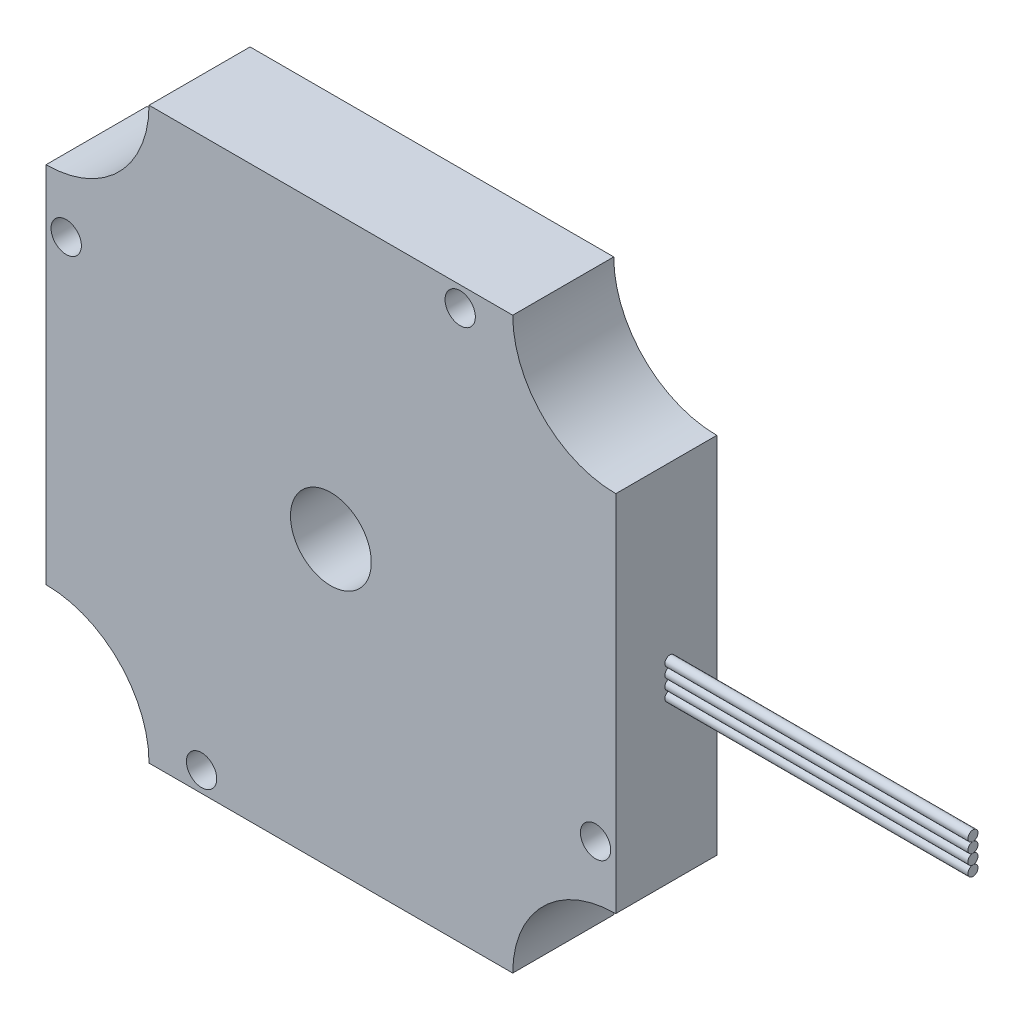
ISO-10303-21;
HEADER;
FILE_DESCRIPTION(('STEP AP214'),'2;1');
FILE_NAME('part.step','',(''),(''),'','','');
FILE_SCHEMA(('AUTOMOTIVE_DESIGN { 1 0 10303 214 1 1 1 1 }'));
ENDSEC;
DATA;
#1=APPLICATION_CONTEXT('core data for automotive mechanical design processes');
#2=APPLICATION_PROTOCOL_DEFINITION('international standard','automotive_design',2000,#1);
#3=PRODUCT_CONTEXT('',#1,'mechanical');
#4=PRODUCT('Part','Part','',(#3));
#5=PRODUCT_RELATED_PRODUCT_CATEGORY('part','',(#4));
#6=PRODUCT_DEFINITION_FORMATION('','',#4);
#7=PRODUCT_DEFINITION_CONTEXT('part definition',#1,'design');
#8=PRODUCT_DEFINITION('design','',#6,#7);
#9=PRODUCT_DEFINITION_SHAPE('','',#8);
#10=(LENGTH_UNIT() NAMED_UNIT(*) SI_UNIT(.MILLI.,.METRE.));
#11=(NAMED_UNIT(*) PLANE_ANGLE_UNIT() SI_UNIT($,.RADIAN.));
#12=(NAMED_UNIT(*) SI_UNIT($,.STERADIAN.) SOLID_ANGLE_UNIT());
#13=UNCERTAINTY_MEASURE_WITH_UNIT(LENGTH_MEASURE(1.E-05),#10,'distance_accuracy_value','');
#14=(GEOMETRIC_REPRESENTATION_CONTEXT(3) GLOBAL_UNCERTAINTY_ASSIGNED_CONTEXT((#13)) GLOBAL_UNIT_ASSIGNED_CONTEXT((#10,
#11,#12)) REPRESENTATION_CONTEXT('',''));
#15=CARTESIAN_POINT('',(0.,0.,0.));
#16=DIRECTION('',(0.,0.,1.));
#17=DIRECTION('',(1.,0.,0.));
#18=AXIS2_PLACEMENT_3D('',#15,#16,#17);
#19=CARTESIAN_POINT('',(58.2,-2.,4.64344868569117));
#20=DIRECTION('',(-1.,0.,0.));
#21=DIRECTION('',(0.,0.,1.));
#22=AXIS2_PLACEMENT_3D('',#19,#20,#21);
#23=CYLINDRICAL_SURFACE('',#22,0.500000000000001);
#24=CARTESIAN_POINT('',(28.2,-2.,4.64344868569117));
#25=DIRECTION('',(1.,0.,0.));
#26=DIRECTION('',(0.,0.,-1.));
#27=AXIS2_PLACEMENT_3D('',#24,#25,#26);
#28=CIRCLE('',#27,0.500000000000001);
#29=CARTESIAN_POINT('',(28.2,-2.,4.14344868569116));
#30=VERTEX_POINT('',#29);
#31=EDGE_CURVE('E12',#30,#30,#28,.T.);
#32=ORIENTED_EDGE('',*,*,#31,.T.);
#33=EDGE_LOOP('',(#32));
#34=FACE_BOUND('',#33,.T.);
#35=CARTESIAN_POINT('',(58.2,-2.,4.64344868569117));
#36=DIRECTION('',(1.,0.,0.));
#37=DIRECTION('',(0.,0.,-1.));
#38=AXIS2_PLACEMENT_3D('',#35,#36,#37);
#39=CIRCLE('',#38,0.500000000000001);
#40=CARTESIAN_POINT('',(58.2,-2.,4.14344868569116));
#41=VERTEX_POINT('',#40);
#42=EDGE_CURVE('E55',#41,#41,#39,.T.);
#43=ORIENTED_EDGE('',*,*,#42,.F.);
#44=EDGE_LOOP('',(#43));
#45=FACE_BOUND('',#44,.T.);
#46=ADVANCED_FACE('F51',(#34,#45),#23,.T.);
#47=CARTESIAN_POINT('',(58.2,-2.,4.64344868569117));
#48=DIRECTION('',(1.,0.,0.));
#49=DIRECTION('',(0.,0.,-1.));
#50=AXIS2_PLACEMENT_3D('',#47,#48,#49);
#51=PLANE('',#50);
#52=ORIENTED_EDGE('',*,*,#42,.T.);
#53=EDGE_LOOP('',(#52));
#54=FACE_BOUND('',#53,.T.);
#55=ADVANCED_FACE('F53',(#54),#51,.T.);
#56=CARTESIAN_POINT('',(28.2,-2.,4.64344868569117));
#57=DIRECTION('',(1.,0.,0.));
#58=DIRECTION('',(0.,0.,-1.));
#59=AXIS2_PLACEMENT_3D('',#56,#57,#58);
#60=PLANE('',#59);
#61=ORIENTED_EDGE('',*,*,#31,.F.);
#62=EDGE_LOOP('',(#61));
#63=FACE_BOUND('',#62,.T.);
#64=ADVANCED_FACE('F70',(#63),#60,.F.);
#65=CLOSED_SHELL('',(#46,#55,#64));
#66=MANIFOLD_SOLID_BREP('B2',#65);
#67=CARTESIAN_POINT('',(58.2,-1.,4.64344868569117));
#68=DIRECTION('',(-1.,0.,0.));
#69=DIRECTION('',(0.,0.,1.));
#70=AXIS2_PLACEMENT_3D('',#67,#68,#69);
#71=CYLINDRICAL_SURFACE('',#70,0.500000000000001);
#72=CARTESIAN_POINT('',(28.2,-1.,4.64344868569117));
#73=DIRECTION('',(1.,0.,0.));
#74=DIRECTION('',(0.,0.,-1.));
#75=AXIS2_PLACEMENT_3D('',#72,#73,#74);
#76=CIRCLE('',#75,0.500000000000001);
#77=CARTESIAN_POINT('',(28.2,-1.,4.14344868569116));
#78=VERTEX_POINT('',#77);
#79=EDGE_CURVE('E50',#78,#78,#76,.T.);
#80=ORIENTED_EDGE('',*,*,#79,.T.);
#81=EDGE_LOOP('',(#80));
#82=FACE_BOUND('',#81,.T.);
#83=CARTESIAN_POINT('',(58.2,-1.,4.64344868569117));
#84=DIRECTION('',(1.,0.,0.));
#85=DIRECTION('',(0.,0.,-1.));
#86=AXIS2_PLACEMENT_3D('',#83,#84,#85);
#87=CIRCLE('',#86,0.500000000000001);
#88=CARTESIAN_POINT('',(58.2,-1.,4.14344868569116));
#89=VERTEX_POINT('',#88);
#90=EDGE_CURVE('E103',#89,#89,#87,.T.);
#91=ORIENTED_EDGE('',*,*,#90,.F.);
#92=EDGE_LOOP('',(#91));
#93=FACE_BOUND('',#92,.T.);
#94=ADVANCED_FACE('F99',(#82,#93),#71,.T.);
#95=CARTESIAN_POINT('',(58.2,-1.,4.64344868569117));
#96=DIRECTION('',(1.,0.,0.));
#97=DIRECTION('',(0.,0.,-1.));
#98=AXIS2_PLACEMENT_3D('',#95,#96,#97);
#99=PLANE('',#98);
#100=ORIENTED_EDGE('',*,*,#90,.T.);
#101=EDGE_LOOP('',(#100));
#102=FACE_BOUND('',#101,.T.);
#103=ADVANCED_FACE('F101',(#102),#99,.T.);
#104=CARTESIAN_POINT('',(28.2,-1.,4.64344868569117));
#105=DIRECTION('',(1.,0.,0.));
#106=DIRECTION('',(0.,0.,-1.));
#107=AXIS2_PLACEMENT_3D('',#104,#105,#106);
#108=PLANE('',#107);
#109=ORIENTED_EDGE('',*,*,#79,.F.);
#110=EDGE_LOOP('',(#109));
#111=FACE_BOUND('',#110,.T.);
#112=ADVANCED_FACE('F118',(#111),#108,.F.);
#113=CLOSED_SHELL('',(#94,#103,#112));
#114=MANIFOLD_SOLID_BREP('B7',#113);
#115=CARTESIAN_POINT('',(58.2,0.,4.64344868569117));
#116=DIRECTION('',(-1.,0.,0.));
#117=DIRECTION('',(0.,0.,1.));
#118=AXIS2_PLACEMENT_3D('',#115,#116,#117);
#119=CYLINDRICAL_SURFACE('',#118,0.500000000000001);
#120=CARTESIAN_POINT('',(28.2,0.,4.64344868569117));
#121=DIRECTION('',(1.,0.,0.));
#122=DIRECTION('',(0.,0.,-1.));
#123=AXIS2_PLACEMENT_3D('',#120,#121,#122);
#124=CIRCLE('',#123,0.500000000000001);
#125=CARTESIAN_POINT('',(28.2,0.,4.14344868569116));
#126=VERTEX_POINT('',#125);
#127=EDGE_CURVE('E98',#126,#126,#124,.T.);
#128=ORIENTED_EDGE('',*,*,#127,.T.);
#129=EDGE_LOOP('',(#128));
#130=FACE_BOUND('',#129,.T.);
#131=CARTESIAN_POINT('',(58.2,0.,4.64344868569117));
#132=DIRECTION('',(1.,0.,0.));
#133=DIRECTION('',(0.,0.,-1.));
#134=AXIS2_PLACEMENT_3D('',#131,#132,#133);
#135=CIRCLE('',#134,0.500000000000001);
#136=CARTESIAN_POINT('',(58.2,0.,4.14344868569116));
#137=VERTEX_POINT('',#136);
#138=EDGE_CURVE('E151',#137,#137,#135,.T.);
#139=ORIENTED_EDGE('',*,*,#138,.F.);
#140=EDGE_LOOP('',(#139));
#141=FACE_BOUND('',#140,.T.);
#142=ADVANCED_FACE('F147',(#130,#141),#119,.T.);
#143=CARTESIAN_POINT('',(58.2,0.,4.64344868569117));
#144=DIRECTION('',(1.,0.,0.));
#145=DIRECTION('',(0.,0.,-1.));
#146=AXIS2_PLACEMENT_3D('',#143,#144,#145);
#147=PLANE('',#146);
#148=ORIENTED_EDGE('',*,*,#138,.T.);
#149=EDGE_LOOP('',(#148));
#150=FACE_BOUND('',#149,.T.);
#151=ADVANCED_FACE('F149',(#150),#147,.T.);
#152=CARTESIAN_POINT('',(28.2,0.,4.64344868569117));
#153=DIRECTION('',(1.,0.,0.));
#154=DIRECTION('',(0.,0.,-1.));
#155=AXIS2_PLACEMENT_3D('',#152,#153,#154);
#156=PLANE('',#155);
#157=ORIENTED_EDGE('',*,*,#127,.F.);
#158=EDGE_LOOP('',(#157));
#159=FACE_BOUND('',#158,.T.);
#160=ADVANCED_FACE('F166',(#159),#156,.F.);
#161=CLOSED_SHELL('',(#142,#151,#160));
#162=MANIFOLD_SOLID_BREP('B45',#161);
#163=CARTESIAN_POINT('',(58.2,1.,4.64344868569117));
#164=DIRECTION('',(-1.,0.,0.));
#165=DIRECTION('',(0.,0.,1.));
#166=AXIS2_PLACEMENT_3D('',#163,#164,#165);
#167=CYLINDRICAL_SURFACE('',#166,0.500000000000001);
#168=CARTESIAN_POINT('',(28.2,1.,4.64344868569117));
#169=DIRECTION('',(1.,0.,0.));
#170=DIRECTION('',(0.,0.,-1.));
#171=AXIS2_PLACEMENT_3D('',#168,#169,#170);
#172=CIRCLE('',#171,0.500000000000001);
#173=CARTESIAN_POINT('',(28.2,1.,4.14344868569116));
#174=VERTEX_POINT('',#173);
#175=EDGE_CURVE('E199',#174,#174,#172,.T.);
#176=ORIENTED_EDGE('',*,*,#175,.T.);
#177=EDGE_LOOP('',(#176));
#178=FACE_BOUND('',#177,.T.);
#179=CARTESIAN_POINT('',(58.2,1.,4.64344868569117));
#180=DIRECTION('',(1.,0.,0.));
#181=DIRECTION('',(0.,0.,-1.));
#182=AXIS2_PLACEMENT_3D('',#179,#180,#181);
#183=CIRCLE('',#182,0.500000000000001);
#184=CARTESIAN_POINT('',(58.2,1.,4.14344868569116));
#185=VERTEX_POINT('',#184);
#186=EDGE_CURVE('E146',#185,#185,#183,.T.);
#187=ORIENTED_EDGE('',*,*,#186,.F.);
#188=EDGE_LOOP('',(#187));
#189=FACE_BOUND('',#188,.T.);
#190=ADVANCED_FACE('F196',(#178,#189),#167,.T.);
#191=CARTESIAN_POINT('',(58.2,1.,4.64344868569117));
#192=DIRECTION('',(1.,0.,0.));
#193=DIRECTION('',(0.,0.,-1.));
#194=AXIS2_PLACEMENT_3D('',#191,#192,#193);
#195=PLANE('',#194);
#196=ORIENTED_EDGE('',*,*,#186,.T.);
#197=EDGE_LOOP('',(#196));
#198=FACE_BOUND('',#197,.T.);
#199=ADVANCED_FACE('F212',(#198),#195,.T.);
#200=CARTESIAN_POINT('',(28.2,1.,4.64344868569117));
#201=DIRECTION('',(1.,0.,0.));
#202=DIRECTION('',(0.,0.,-1.));
#203=AXIS2_PLACEMENT_3D('',#200,#201,#202);
#204=PLANE('',#203);
#205=ORIENTED_EDGE('',*,*,#175,.F.);
#206=EDGE_LOOP('',(#205));
#207=FACE_BOUND('',#206,.T.);
#208=ADVANCED_FACE('F210',(#207),#204,.F.);
#209=CLOSED_SHELL('',(#190,#199,#208));
#210=MANIFOLD_SOLID_BREP('B93',#209);
#211=CARTESIAN_POINT('',(-28.2,28.2,10.));
#212=DIRECTION('',(0.,0.,-1.));
#213=DIRECTION('',(-1.,0.,0.));
#214=AXIS2_PLACEMENT_3D('',#211,#212,#213);
#215=CYLINDRICAL_SURFACE('',#214,10.2);
#216=CARTESIAN_POINT('',(-28.2,28.2,0.));
#217=DIRECTION('',(0.,0.,-1.));
#218=DIRECTION('',(1.,0.,0.));
#219=AXIS2_PLACEMENT_3D('',#216,#217,#218);
#220=CIRCLE('',#219,10.2);
#221=CARTESIAN_POINT('',(-18.,28.2,0.));
#222=VERTEX_POINT('',#221);
#223=CARTESIAN_POINT('',(-28.2,18.,0.));
#224=VERTEX_POINT('',#223);
#225=EDGE_CURVE('E333',#222,#224,#220,.T.);
#226=ORIENTED_EDGE('',*,*,#225,.T.);
#227=DIRECTION('',(0.,0.,-1.));
#228=VECTOR('',#227,1.);
#229=CARTESIAN_POINT('',(-28.2,18.,10.));
#230=LINE('',#229,#228);
#231=CARTESIAN_POINT('',(-28.2,18.,10.));
#232=VERTEX_POINT('',#231);
#233=EDGE_CURVE('E194',#232,#224,#230,.T.);
#234=ORIENTED_EDGE('',*,*,#233,.F.);
#235=CARTESIAN_POINT('',(-28.2,28.2,10.));
#236=DIRECTION('',(0.,0.,-1.));
#237=DIRECTION('',(1.,0.,0.));
#238=AXIS2_PLACEMENT_3D('',#235,#236,#237);
#239=CIRCLE('',#238,10.2);
#240=CARTESIAN_POINT('',(-18.,28.2,10.));
#241=VERTEX_POINT('',#240);
#242=EDGE_CURVE('E348',#241,#232,#239,.T.);
#243=ORIENTED_EDGE('',*,*,#242,.F.);
#244=DIRECTION('',(0.,0.,-1.));
#245=VECTOR('',#244,1.);
#246=CARTESIAN_POINT('',(-18.,28.2,10.));
#247=LINE('',#246,#245);
#248=EDGE_CURVE('E329',#241,#222,#247,.T.);
#249=ORIENTED_EDGE('',*,*,#248,.T.);
#250=EDGE_LOOP('',(#226,#234,#243,#249));
#251=FACE_BOUND('',#250,.T.);
#252=ADVANCED_FACE('F237',(#251),#215,.F.);
#253=CARTESIAN_POINT('',(-28.2,-18.,10.));
#254=DIRECTION('',(1.,0.,0.));
#255=DIRECTION('',(0.,0.,-1.));
#256=AXIS2_PLACEMENT_3D('',#253,#254,#255);
#257=PLANE('',#256);
#258=DIRECTION('',(0.,-1.,0.));
#259=VECTOR('',#258,1.);
#260=CARTESIAN_POINT('',(-28.2,-18.,0.));
#261=LINE('',#260,#259);
#262=CARTESIAN_POINT('',(-28.2,-18.,0.));
#263=VERTEX_POINT('',#262);
#264=EDGE_CURVE('E336',#224,#263,#261,.T.);
#265=ORIENTED_EDGE('',*,*,#264,.T.);
#266=DIRECTION('',(0.,0.,-1.));
#267=VECTOR('',#266,1.);
#268=CARTESIAN_POINT('',(-28.2,-18.,10.));
#269=LINE('',#268,#267);
#270=CARTESIAN_POINT('',(-28.2,-18.,10.));
#271=VERTEX_POINT('',#270);
#272=EDGE_CURVE('E245',#271,#263,#269,.T.);
#273=ORIENTED_EDGE('',*,*,#272,.F.);
#274=DIRECTION('',(0.,-1.,0.));
#275=VECTOR('',#274,1.);
#276=CARTESIAN_POINT('',(-28.2,-18.,10.));
#277=LINE('',#276,#275);
#278=EDGE_CURVE('E296',#232,#271,#277,.T.);
#279=ORIENTED_EDGE('',*,*,#278,.F.);
#280=ORIENTED_EDGE('',*,*,#233,.T.);
#281=EDGE_LOOP('',(#265,#273,#279,#280));
#282=FACE_BOUND('',#281,.T.);
#283=ADVANCED_FACE('F439',(#282),#257,.F.);
#284=CARTESIAN_POINT('',(-28.2,-28.2,10.));
#285=DIRECTION('',(0.,0.,-1.));
#286=DIRECTION('',(-1.,0.,0.));
#287=AXIS2_PLACEMENT_3D('',#284,#285,#286);
#288=CYLINDRICAL_SURFACE('',#287,10.2);
#289=CARTESIAN_POINT('',(-28.2,-28.2,0.));
#290=DIRECTION('',(0.,0.,-1.));
#291=DIRECTION('',(1.,0.,0.));
#292=AXIS2_PLACEMENT_3D('',#289,#290,#291);
#293=CIRCLE('',#292,10.2);
#294=CARTESIAN_POINT('',(-18.,-28.2,0.));
#295=VERTEX_POINT('',#294);
#296=EDGE_CURVE('E339',#263,#295,#293,.T.);
#297=ORIENTED_EDGE('',*,*,#296,.T.);
#298=DIRECTION('',(0.,0.,-1.));
#299=VECTOR('',#298,1.);
#300=CARTESIAN_POINT('',(-18.,-28.2,10.));
#301=LINE('',#300,#299);
#302=CARTESIAN_POINT('',(-18.,-28.2,10.));
#303=VERTEX_POINT('',#302);
#304=EDGE_CURVE('E355',#303,#295,#301,.T.);
#305=ORIENTED_EDGE('',*,*,#304,.F.);
#306=CARTESIAN_POINT('',(-28.2,-28.2,10.));
#307=DIRECTION('',(0.,0.,-1.));
#308=DIRECTION('',(1.,0.,0.));
#309=AXIS2_PLACEMENT_3D('',#306,#307,#308);
#310=CIRCLE('',#309,10.2);
#311=EDGE_CURVE('E363',#271,#303,#310,.T.);
#312=ORIENTED_EDGE('',*,*,#311,.F.);
#313=ORIENTED_EDGE('',*,*,#272,.T.);
#314=EDGE_LOOP('',(#297,#305,#312,#313));
#315=FACE_BOUND('',#314,.T.);
#316=ADVANCED_FACE('F361',(#315),#288,.F.);
#317=CARTESIAN_POINT('',(-18.,-28.2,10.));
#318=DIRECTION('',(0.,1.,0.));
#319=DIRECTION('',(0.,0.,1.));
#320=AXIS2_PLACEMENT_3D('',#317,#318,#319);
#321=PLANE('',#320);
#322=DIRECTION('',(1.,0.,0.));
#323=VECTOR('',#322,1.);
#324=CARTESIAN_POINT('',(-18.,-28.2,0.));
#325=LINE('',#324,#323);
#326=CARTESIAN_POINT('',(18.,-28.2,0.));
#327=VERTEX_POINT('',#326);
#328=EDGE_CURVE('E341',#295,#327,#325,.T.);
#329=ORIENTED_EDGE('',*,*,#328,.T.);
#330=DIRECTION('',(0.,0.,-1.));
#331=VECTOR('',#330,1.);
#332=CARTESIAN_POINT('',(18.,-28.2,10.));
#333=LINE('',#332,#331);
#334=CARTESIAN_POINT('',(18.,-28.2,10.));
#335=VERTEX_POINT('',#334);
#336=EDGE_CURVE('E352',#335,#327,#333,.T.);
#337=ORIENTED_EDGE('',*,*,#336,.F.);
#338=DIRECTION('',(1.,0.,0.));
#339=VECTOR('',#338,1.);
#340=CARTESIAN_POINT('',(-18.,-28.2,10.));
#341=LINE('',#340,#339);
#342=EDGE_CURVE('E375',#303,#335,#341,.T.);
#343=ORIENTED_EDGE('',*,*,#342,.F.);
#344=ORIENTED_EDGE('',*,*,#304,.T.);
#345=EDGE_LOOP('',(#329,#337,#343,#344));
#346=FACE_BOUND('',#345,.T.);
#347=ADVANCED_FACE('F371',(#346),#321,.F.);
#348=CARTESIAN_POINT('',(28.2,-28.2,10.));
#349=DIRECTION('',(0.,0.,-1.));
#350=DIRECTION('',(-1.,0.,0.));
#351=AXIS2_PLACEMENT_3D('',#348,#349,#350);
#352=CYLINDRICAL_SURFACE('',#351,10.2);
#353=CARTESIAN_POINT('',(28.2,-28.2,0.));
#354=DIRECTION('',(0.,0.,-1.));
#355=DIRECTION('',(1.,0.,0.));
#356=AXIS2_PLACEMENT_3D('',#353,#354,#355);
#357=CIRCLE('',#356,10.2);
#358=CARTESIAN_POINT('',(28.2,-18.,0.));
#359=VERTEX_POINT('',#358);
#360=EDGE_CURVE('E343',#327,#359,#357,.T.);
#361=ORIENTED_EDGE('',*,*,#360,.T.);
#362=DIRECTION('',(0.,0.,-1.));
#363=VECTOR('',#362,1.);
#364=CARTESIAN_POINT('',(28.2,-18.,10.));
#365=LINE('',#364,#363);
#366=CARTESIAN_POINT('',(28.2,-18.,10.));
#367=VERTEX_POINT('',#366);
#368=EDGE_CURVE('E324',#367,#359,#365,.T.);
#369=ORIENTED_EDGE('',*,*,#368,.F.);
#370=CARTESIAN_POINT('',(28.2,-28.2,10.));
#371=DIRECTION('',(0.,0.,-1.));
#372=DIRECTION('',(1.,0.,0.));
#373=AXIS2_PLACEMENT_3D('',#370,#371,#372);
#374=CIRCLE('',#373,10.2);
#375=EDGE_CURVE('E315',#335,#367,#374,.T.);
#376=ORIENTED_EDGE('',*,*,#375,.F.);
#377=ORIENTED_EDGE('',*,*,#336,.T.);
#378=EDGE_LOOP('',(#361,#369,#376,#377));
#379=FACE_BOUND('',#378,.T.);
#380=ADVANCED_FACE('F374',(#379),#352,.F.);
#381=CARTESIAN_POINT('',(28.2,-18.,10.));
#382=DIRECTION('',(-1.,0.,0.));
#383=DIRECTION('',(0.,0.,1.));
#384=AXIS2_PLACEMENT_3D('',#381,#382,#383);
#385=PLANE('',#384);
#386=DIRECTION('',(0.,1.,0.));
#387=VECTOR('',#386,1.);
#388=CARTESIAN_POINT('',(28.2,-18.,0.));
#389=LINE('',#388,#387);
#390=CARTESIAN_POINT('',(28.2,18.,0.));
#391=VERTEX_POINT('',#390);
#392=EDGE_CURVE('E323',#359,#391,#389,.T.);
#393=ORIENTED_EDGE('',*,*,#392,.T.);
#394=DIRECTION('',(0.,0.,-1.));
#395=VECTOR('',#394,1.);
#396=CARTESIAN_POINT('',(28.2,18.,10.));
#397=LINE('',#396,#395);
#398=CARTESIAN_POINT('',(28.2,18.,10.));
#399=VERTEX_POINT('',#398);
#400=EDGE_CURVE('E320',#399,#391,#397,.T.);
#401=ORIENTED_EDGE('',*,*,#400,.F.);
#402=DIRECTION('',(0.,1.,0.));
#403=VECTOR('',#402,1.);
#404=CARTESIAN_POINT('',(28.2,-18.,10.));
#405=LINE('',#404,#403);
#406=EDGE_CURVE('E309',#367,#399,#405,.T.);
#407=ORIENTED_EDGE('',*,*,#406,.F.);
#408=ORIENTED_EDGE('',*,*,#368,.T.);
#409=EDGE_LOOP('',(#393,#401,#407,#408));
#410=FACE_BOUND('',#409,.T.);
#411=ADVANCED_FACE('F321',(#410),#385,.F.);
#412=CARTESIAN_POINT('',(28.2,28.2,10.));
#413=DIRECTION('',(0.,0.,-1.));
#414=DIRECTION('',(-1.,0.,0.));
#415=AXIS2_PLACEMENT_3D('',#412,#413,#414);
#416=CYLINDRICAL_SURFACE('',#415,10.2);
#417=CARTESIAN_POINT('',(28.2,28.2,0.));
#418=DIRECTION('',(0.,0.,-1.));
#419=DIRECTION('',(1.,0.,0.));
#420=AXIS2_PLACEMENT_3D('',#417,#418,#419);
#421=CIRCLE('',#420,10.2);
#422=CARTESIAN_POINT('',(18.,28.2,0.));
#423=VERTEX_POINT('',#422);
#424=EDGE_CURVE('E282',#391,#423,#421,.T.);
#425=ORIENTED_EDGE('',*,*,#424,.T.);
#426=DIRECTION('',(0.,0.,-1.));
#427=VECTOR('',#426,1.);
#428=CARTESIAN_POINT('',(18.,28.2,10.));
#429=LINE('',#428,#427);
#430=CARTESIAN_POINT('',(18.,28.2,10.));
#431=VERTEX_POINT('',#430);
#432=EDGE_CURVE('E325',#431,#423,#429,.T.);
#433=ORIENTED_EDGE('',*,*,#432,.F.);
#434=CARTESIAN_POINT('',(28.2,28.2,10.));
#435=DIRECTION('',(0.,0.,-1.));
#436=DIRECTION('',(1.,0.,0.));
#437=AXIS2_PLACEMENT_3D('',#434,#435,#436);
#438=CIRCLE('',#437,10.2);
#439=EDGE_CURVE('E313',#399,#431,#438,.T.);
#440=ORIENTED_EDGE('',*,*,#439,.F.);
#441=ORIENTED_EDGE('',*,*,#400,.T.);
#442=EDGE_LOOP('',(#425,#433,#440,#441));
#443=FACE_BOUND('',#442,.T.);
#444=ADVANCED_FACE('F327',(#443),#416,.F.);
#445=CARTESIAN_POINT('',(18.,28.2,10.));
#446=DIRECTION('',(0.,-1.,0.));
#447=DIRECTION('',(0.,0.,-1.));
#448=AXIS2_PLACEMENT_3D('',#445,#446,#447);
#449=PLANE('',#448);
#450=DIRECTION('',(-1.,0.,0.));
#451=VECTOR('',#450,1.);
#452=CARTESIAN_POINT('',(18.,28.2,0.));
#453=LINE('',#452,#451);
#454=EDGE_CURVE('E288',#423,#222,#453,.T.);
#455=ORIENTED_EDGE('',*,*,#454,.T.);
#456=ORIENTED_EDGE('',*,*,#248,.F.);
#457=DIRECTION('',(-1.,0.,0.));
#458=VECTOR('',#457,1.);
#459=CARTESIAN_POINT('',(18.,28.2,10.));
#460=LINE('',#459,#458);
#461=EDGE_CURVE('E253',#431,#241,#460,.T.);
#462=ORIENTED_EDGE('',*,*,#461,.F.);
#463=ORIENTED_EDGE('',*,*,#432,.T.);
#464=EDGE_LOOP('',(#455,#456,#462,#463));
#465=FACE_BOUND('',#464,.T.);
#466=ADVANCED_FACE('F446',(#465),#449,.F.);
#467=CARTESIAN_POINT('',(-28.2,28.2,10.));
#468=DIRECTION('',(0.,0.,1.));
#469=DIRECTION('',(1.,0.,0.));
#470=AXIS2_PLACEMENT_3D('',#467,#468,#469);
#471=PLANE('',#470);
#472=CARTESIAN_POINT('',(-26.1999999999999,12.8000000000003,10.));
#473=DIRECTION('',(0.,0.,1.));
#474=DIRECTION('',(1.,0.,0.));
#475=AXIS2_PLACEMENT_3D('',#472,#473,#474);
#476=CIRCLE('',#475,1.5);
#477=CARTESIAN_POINT('',(-24.6999999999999,12.8000000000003,10.));
#478=VERTEX_POINT('',#477);
#479=EDGE_CURVE('E404',#478,#478,#476,.T.);
#480=ORIENTED_EDGE('',*,*,#479,.F.);
#481=EDGE_LOOP('',(#480));
#482=FACE_BOUND('',#481,.T.);
#483=CARTESIAN_POINT('',(-12.8,-26.2,10.));
#484=DIRECTION('',(0.,0.,1.));
#485=DIRECTION('',(1.,0.,0.));
#486=AXIS2_PLACEMENT_3D('',#483,#484,#485);
#487=CIRCLE('',#486,1.5);
#488=CARTESIAN_POINT('',(-11.3,-26.2,10.));
#489=VERTEX_POINT('',#488);
#490=EDGE_CURVE('E398',#489,#489,#487,.T.);
#491=ORIENTED_EDGE('',*,*,#490,.F.);
#492=EDGE_LOOP('',(#491));
#493=FACE_BOUND('',#492,.T.);
#494=CARTESIAN_POINT('',(26.1999999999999,-12.8000000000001,10.));
#495=DIRECTION('',(0.,0.,1.));
#496=DIRECTION('',(1.,0.,0.));
#497=AXIS2_PLACEMENT_3D('',#494,#495,#496);
#498=CIRCLE('',#497,1.5);
#499=CARTESIAN_POINT('',(27.6999999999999,-12.8000000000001,10.));
#500=VERTEX_POINT('',#499);
#501=EDGE_CURVE('E392',#500,#500,#498,.T.);
#502=ORIENTED_EDGE('',*,*,#501,.F.);
#503=EDGE_LOOP('',(#502));
#504=FACE_BOUND('',#503,.T.);
#505=CARTESIAN_POINT('',(12.8,26.2,10.));
#506=DIRECTION('',(0.,0.,1.));
#507=DIRECTION('',(1.,0.,0.));
#508=AXIS2_PLACEMENT_3D('',#505,#506,#507);
#509=CIRCLE('',#508,1.5);
#510=CARTESIAN_POINT('',(14.3,26.2,10.));
#511=VERTEX_POINT('',#510);
#512=EDGE_CURVE('E384',#511,#511,#509,.T.);
#513=ORIENTED_EDGE('',*,*,#512,.F.);
#514=EDGE_LOOP('',(#513));
#515=FACE_BOUND('',#514,.T.);
#516=CARTESIAN_POINT('',(0.,0.,10.));
#517=DIRECTION('',(0.,0.,-1.));
#518=DIRECTION('',(-1.,0.,0.));
#519=AXIS2_PLACEMENT_3D('',#516,#517,#518);
#520=CIRCLE('',#519,4.);
#521=CARTESIAN_POINT('',(-4.,0.,10.));
#522=VERTEX_POINT('',#521);
#523=EDGE_CURVE('E337',#522,#522,#520,.T.);
#524=ORIENTED_EDGE('',*,*,#523,.T.);
#525=EDGE_LOOP('',(#524));
#526=FACE_BOUND('',#525,.T.);
#527=ORIENTED_EDGE('',*,*,#242,.T.);
#528=ORIENTED_EDGE('',*,*,#278,.T.);
#529=ORIENTED_EDGE('',*,*,#311,.T.);
#530=ORIENTED_EDGE('',*,*,#342,.T.);
#531=ORIENTED_EDGE('',*,*,#375,.T.);
#532=ORIENTED_EDGE('',*,*,#406,.T.);
#533=ORIENTED_EDGE('',*,*,#439,.T.);
#534=ORIENTED_EDGE('',*,*,#461,.T.);
#535=EDGE_LOOP('',(#527,#528,#529,#530,#531,#532,#533,#534));
#536=FACE_BOUND('',#535,.T.);
#537=ADVANCED_FACE('F311',(#482,#493,#504,#515,#526,#536),#471,.T.);
#538=CARTESIAN_POINT('',(-28.2,28.2,0.));
#539=DIRECTION('',(0.,0.,1.));
#540=DIRECTION('',(1.,0.,0.));
#541=AXIS2_PLACEMENT_3D('',#538,#539,#540);
#542=PLANE('',#541);
#543=CARTESIAN_POINT('',(-26.1999999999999,12.8000000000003,0.));
#544=DIRECTION('',(0.,0.,-1.));
#545=DIRECTION('',(0.,-1.,0.));
#546=AXIS2_PLACEMENT_3D('',#543,#544,#545);
#547=CIRCLE('',#546,1.5);
#548=CARTESIAN_POINT('',(-26.1999999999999,11.3000000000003,0.));
#549=VERTEX_POINT('',#548);
#550=EDGE_CURVE('E407',#549,#549,#547,.T.);
#551=ORIENTED_EDGE('',*,*,#550,.F.);
#552=EDGE_LOOP('',(#551));
#553=FACE_BOUND('',#552,.T.);
#554=CARTESIAN_POINT('',(-12.8,-26.2,0.));
#555=DIRECTION('',(0.,0.,-1.));
#556=DIRECTION('',(1.,0.,0.));
#557=AXIS2_PLACEMENT_3D('',#554,#555,#556);
#558=CIRCLE('',#557,1.5);
#559=CARTESIAN_POINT('',(-11.3,-26.2,0.));
#560=VERTEX_POINT('',#559);
#561=EDGE_CURVE('E401',#560,#560,#558,.T.);
#562=ORIENTED_EDGE('',*,*,#561,.F.);
#563=EDGE_LOOP('',(#562));
#564=FACE_BOUND('',#563,.T.);
#565=CARTESIAN_POINT('',(26.1999999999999,-12.8000000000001,0.));
#566=DIRECTION('',(0.,0.,-1.));
#567=DIRECTION('',(0.,1.,0.));
#568=AXIS2_PLACEMENT_3D('',#565,#566,#567);
#569=CIRCLE('',#568,1.5);
#570=CARTESIAN_POINT('',(26.2,-11.3000000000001,0.));
#571=VERTEX_POINT('',#570);
#572=EDGE_CURVE('E395',#571,#571,#569,.T.);
#573=ORIENTED_EDGE('',*,*,#572,.F.);
#574=EDGE_LOOP('',(#573));
#575=FACE_BOUND('',#574,.T.);
#576=CARTESIAN_POINT('',(12.8,26.2,0.));
#577=DIRECTION('',(0.,0.,-1.));
#578=DIRECTION('',(-1.,0.,0.));
#579=AXIS2_PLACEMENT_3D('',#576,#577,#578);
#580=CIRCLE('',#579,1.5);
#581=CARTESIAN_POINT('',(11.3,26.2,0.));
#582=VERTEX_POINT('',#581);
#583=EDGE_CURVE('E389',#582,#582,#580,.T.);
#584=ORIENTED_EDGE('',*,*,#583,.F.);
#585=EDGE_LOOP('',(#584));
#586=FACE_BOUND('',#585,.T.);
#587=CARTESIAN_POINT('',(0.,0.,0.));
#588=DIRECTION('',(0.,0.,-1.));
#589=DIRECTION('',(-1.,0.,0.));
#590=AXIS2_PLACEMENT_3D('',#587,#588,#589);
#591=CIRCLE('',#590,4.);
#592=CARTESIAN_POINT('',(-4.,0.,0.));
#593=VERTEX_POINT('',#592);
#594=EDGE_CURVE('E381',#593,#593,#591,.T.);
#595=ORIENTED_EDGE('',*,*,#594,.F.);
#596=EDGE_LOOP('',(#595));
#597=FACE_BOUND('',#596,.T.);
#598=ORIENTED_EDGE('',*,*,#225,.F.);
#599=ORIENTED_EDGE('',*,*,#454,.F.);
#600=ORIENTED_EDGE('',*,*,#424,.F.);
#601=ORIENTED_EDGE('',*,*,#392,.F.);
#602=ORIENTED_EDGE('',*,*,#360,.F.);
#603=ORIENTED_EDGE('',*,*,#328,.F.);
#604=ORIENTED_EDGE('',*,*,#296,.F.);
#605=ORIENTED_EDGE('',*,*,#264,.F.);
#606=EDGE_LOOP('',(#598,#599,#600,#601,#602,#603,#604,#605));
#607=FACE_BOUND('',#606,.T.);
#608=ADVANCED_FACE('F367',(#553,#564,#575,#586,#597,#607),#542,.F.);
#609=CARTESIAN_POINT('',(0.,0.,10.));
#610=DIRECTION('',(0.,0.,-1.));
#611=DIRECTION('',(-1.,0.,0.));
#612=AXIS2_PLACEMENT_3D('',#609,#610,#611);
#613=CYLINDRICAL_SURFACE('',#612,4.);
#614=ORIENTED_EDGE('',*,*,#523,.F.);
#615=EDGE_LOOP('',(#614));
#616=FACE_BOUND('',#615,.T.);
#617=ORIENTED_EDGE('',*,*,#594,.T.);
#618=EDGE_LOOP('',(#617));
#619=FACE_BOUND('',#618,.T.);
#620=ADVANCED_FACE('F415',(#616,#619),#613,.F.);
#621=CARTESIAN_POINT('',(12.8,26.2,50.));
#622=DIRECTION('',(0.,0.,-1.));
#623=DIRECTION('',(-1.,0.,0.));
#624=AXIS2_PLACEMENT_3D('',#621,#622,#623);
#625=CYLINDRICAL_SURFACE('',#624,1.5);
#626=ORIENTED_EDGE('',*,*,#512,.T.);
#627=EDGE_LOOP('',(#626));
#628=FACE_BOUND('',#627,.T.);
#629=ORIENTED_EDGE('',*,*,#583,.T.);
#630=EDGE_LOOP('',(#629));
#631=FACE_BOUND('',#630,.T.);
#632=ADVANCED_FACE('F426',(#628,#631),#625,.F.);
#633=CARTESIAN_POINT('',(26.1999999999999,-12.8000000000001,50.));
#634=DIRECTION('',(0.,0.,-1.));
#635=DIRECTION('',(-1.,0.,0.));
#636=AXIS2_PLACEMENT_3D('',#633,#634,#635);
#637=CYLINDRICAL_SURFACE('',#636,1.5);
#638=ORIENTED_EDGE('',*,*,#501,.T.);
#639=EDGE_LOOP('',(#638));
#640=FACE_BOUND('',#639,.T.);
#641=ORIENTED_EDGE('',*,*,#572,.T.);
#642=EDGE_LOOP('',(#641));
#643=FACE_BOUND('',#642,.T.);
#644=ADVANCED_FACE('F433',(#640,#643),#637,.F.);
#645=CARTESIAN_POINT('',(-12.8,-26.2,50.));
#646=DIRECTION('',(0.,0.,-1.));
#647=DIRECTION('',(-1.,0.,0.));
#648=AXIS2_PLACEMENT_3D('',#645,#646,#647);
#649=CYLINDRICAL_SURFACE('',#648,1.5);
#650=ORIENTED_EDGE('',*,*,#490,.T.);
#651=EDGE_LOOP('',(#650));
#652=FACE_BOUND('',#651,.T.);
#653=ORIENTED_EDGE('',*,*,#561,.T.);
#654=EDGE_LOOP('',(#653));
#655=FACE_BOUND('',#654,.T.);
#656=ADVANCED_FACE('F513',(#652,#655),#649,.F.);
#657=CARTESIAN_POINT('',(-26.1999999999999,12.8000000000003,50.));
#658=DIRECTION('',(0.,0.,-1.));
#659=DIRECTION('',(-1.,0.,0.));
#660=AXIS2_PLACEMENT_3D('',#657,#658,#659);
#661=CYLINDRICAL_SURFACE('',#660,1.5);
#662=ORIENTED_EDGE('',*,*,#479,.T.);
#663=EDGE_LOOP('',(#662));
#664=FACE_BOUND('',#663,.T.);
#665=ORIENTED_EDGE('',*,*,#550,.T.);
#666=EDGE_LOOP('',(#665));
#667=FACE_BOUND('',#666,.T.);
#668=ADVANCED_FACE('F411',(#664,#667),#661,.F.);
#669=CLOSED_SHELL('',(#252,#283,#316,#347,#380,#411,#444,#466,#537,#608,#620,#632,#644,#656,#668));
#670=MANIFOLD_SOLID_BREP('B141',#669);
#671=ADVANCED_BREP_SHAPE_REPRESENTATION('',(#18,#66,#114,#162,#210,#670),#14);
#672=SHAPE_DEFINITION_REPRESENTATION(#9,#671);
ENDSEC;
END-ISO-10303-21;
